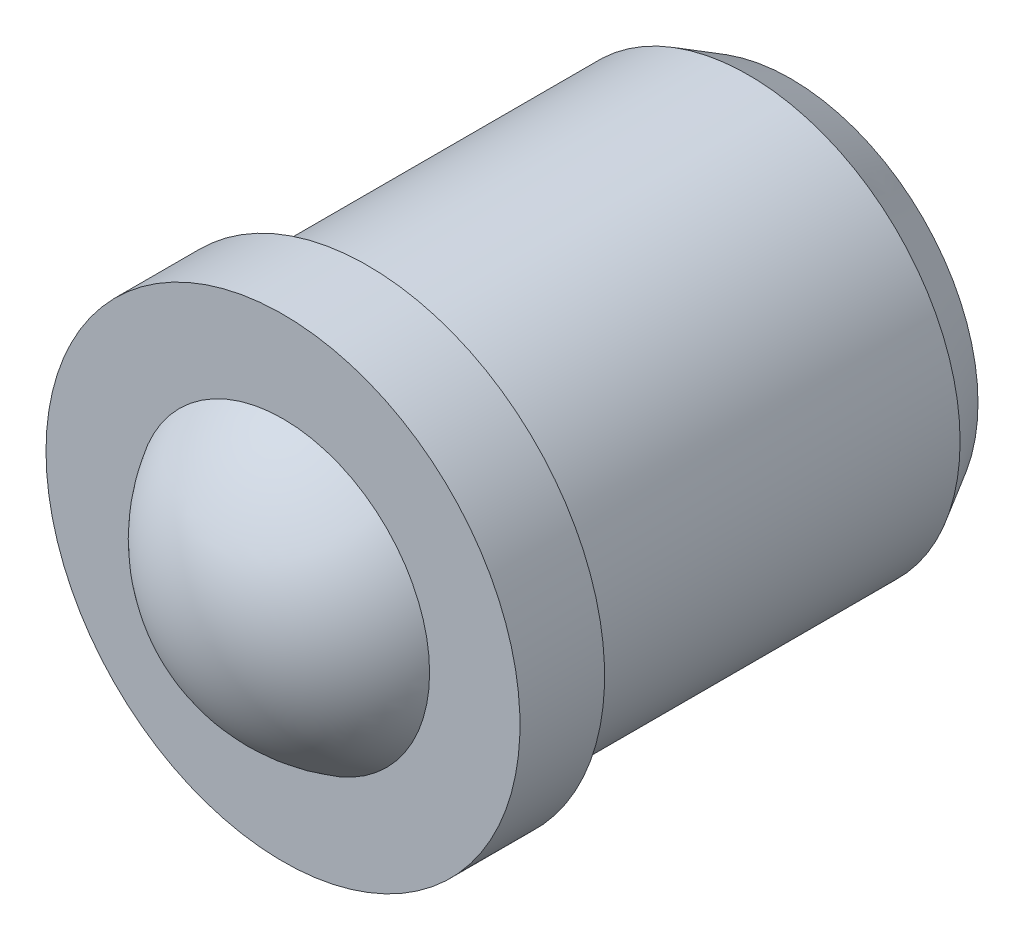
ISO-10303-21;
HEADER;
FILE_DESCRIPTION(('STEP AP214'),'2;1');
FILE_NAME('part.step','',(''),(''),'','','');
FILE_SCHEMA(('AUTOMOTIVE_DESIGN { 1 0 10303 214 1 1 1 1 }'));
ENDSEC;
DATA;
#1=APPLICATION_CONTEXT('core data for automotive mechanical design processes');
#2=APPLICATION_PROTOCOL_DEFINITION('international standard','automotive_design',2000,#1);
#3=PRODUCT_CONTEXT('',#1,'mechanical');
#4=PRODUCT('Part','Part','',(#3));
#5=PRODUCT_RELATED_PRODUCT_CATEGORY('part','',(#4));
#6=PRODUCT_DEFINITION_FORMATION('','',#4);
#7=PRODUCT_DEFINITION_CONTEXT('part definition',#1,'design');
#8=PRODUCT_DEFINITION('design','',#6,#7);
#9=PRODUCT_DEFINITION_SHAPE('','',#8);
#10=(LENGTH_UNIT() NAMED_UNIT(*) SI_UNIT(.MILLI.,.METRE.));
#11=(NAMED_UNIT(*) PLANE_ANGLE_UNIT() SI_UNIT($,.RADIAN.));
#12=(NAMED_UNIT(*) SI_UNIT($,.STERADIAN.) SOLID_ANGLE_UNIT());
#13=UNCERTAINTY_MEASURE_WITH_UNIT(LENGTH_MEASURE(1.E-05),#10,'distance_accuracy_value','');
#14=(GEOMETRIC_REPRESENTATION_CONTEXT(3) GLOBAL_UNCERTAINTY_ASSIGNED_CONTEXT((#13)) GLOBAL_UNIT_ASSIGNED_CONTEXT((#10,
#11,#12)) REPRESENTATION_CONTEXT('',''));
#15=CARTESIAN_POINT('',(0.,0.,0.));
#16=DIRECTION('',(0.,0.,1.));
#17=DIRECTION('',(1.,0.,0.));
#18=AXIS2_PLACEMENT_3D('',#15,#16,#17);
#19=CARTESIAN_POINT('',(0.,0.,0.));
#20=DIRECTION('',(-1.,0.,0.));
#21=DIRECTION('',(0.,0.,-1.));
#22=AXIS2_PLACEMENT_3D('',#19,#20,#21);
#23=SPHERICAL_SURFACE('',#22,2.);
#24=CARTESIAN_POINT('',(0.,0.,0.));
#25=DIRECTION('',(0.,0.,1.));
#26=DIRECTION('',(-1.,0.,0.));
#27=AXIS2_PLACEMENT_3D('',#24,#25,#26);
#28=SPHERICAL_SURFACE('',#27,2.);
#29=CARTESIAN_POINT('',(0.,0.,1.));
#30=DIRECTION('',(0.,0.,1.));
#31=DIRECTION('',(-1.,0.,0.));
#32=AXIS2_PLACEMENT_3D('',#29,#30,#31);
#33=CIRCLE('',#32,1.73205080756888);
#34=CARTESIAN_POINT('',(-1.73205080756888,0.,1.));
#35=VERTEX_POINT('',#34);
#36=EDGE_CURVE('E35',#35,#35,#33,.T.);
#37=ORIENTED_EDGE('',*,*,#36,.T.);
#38=EDGE_LOOP('',(#37));
#39=FACE_BOUND('',#38,.T.);
#40=ADVANCED_FACE('F12',(#39),#28,.T.);
#41=CARTESIAN_POINT('',(0.,0.,-5.));
#42=DIRECTION('',(0.,0.,1.));
#43=DIRECTION('',(-1.,0.,0.));
#44=AXIS2_PLACEMENT_3D('',#41,#42,#43);
#45=PLANE('',#44);
#46=CARTESIAN_POINT('',(0.,0.,-5.));
#47=DIRECTION('',(0.,0.,1.));
#48=DIRECTION('',(1.,0.,0.));
#49=AXIS2_PLACEMENT_3D('',#46,#47,#48);
#50=CIRCLE('',#49,2.21132486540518);
#51=CARTESIAN_POINT('',(2.21132486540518,0.,-5.));
#52=VERTEX_POINT('',#51);
#53=EDGE_CURVE('E8',#52,#52,#50,.F.);
#54=ORIENTED_EDGE('',*,*,#53,.T.);
#55=EDGE_LOOP('',(#54));
#56=FACE_BOUND('',#55,.T.);
#57=ADVANCED_FACE('F60',(#56),#45,.F.);
#58=CARTESIAN_POINT('',(0.,0.,2.));
#59=DIRECTION('',(0.,0.,1.));
#60=DIRECTION('',(-1.,0.,0.));
#61=AXIS2_PLACEMENT_3D('',#58,#59,#60);
#62=CYLINDRICAL_SURFACE('',#61,2.5);
#63=CARTESIAN_POINT('',(0.,0.,-4.5));
#64=DIRECTION('',(0.,0.,1.));
#65=DIRECTION('',(1.,0.,0.));
#66=AXIS2_PLACEMENT_3D('',#63,#64,#65);
#67=CIRCLE('',#66,2.5);
#68=CARTESIAN_POINT('',(2.5,0.,-4.5));
#69=VERTEX_POINT('',#68);
#70=EDGE_CURVE('E19',#69,#69,#67,.T.);
#71=ORIENTED_EDGE('',*,*,#70,.T.);
#72=EDGE_LOOP('',(#71));
#73=FACE_BOUND('',#72,.T.);
#74=CARTESIAN_POINT('',(0.,0.,0.));
#75=DIRECTION('',(0.,0.,1.));
#76=DIRECTION('',(-1.,0.,0.));
#77=AXIS2_PLACEMENT_3D('',#74,#75,#76);
#78=CIRCLE('',#77,2.5);
#79=CARTESIAN_POINT('',(-2.5,0.,0.));
#80=VERTEX_POINT('',#79);
#81=EDGE_CURVE('E23',#80,#80,#78,.T.);
#82=ORIENTED_EDGE('',*,*,#81,.F.);
#83=EDGE_LOOP('',(#82));
#84=FACE_BOUND('',#83,.T.);
#85=ADVANCED_FACE('F55',(#73,#84),#62,.T.);
#86=CARTESIAN_POINT('',(0.,-2.5,0.));
#87=DIRECTION('',(0.,0.,1.));
#88=DIRECTION('',(-1.,0.,0.));
#89=AXIS2_PLACEMENT_3D('',#86,#87,#88);
#90=PLANE('',#89);
#91=CARTESIAN_POINT('',(0.,0.,0.));
#92=DIRECTION('',(0.,0.,1.));
#93=DIRECTION('',(-1.,0.,0.));
#94=AXIS2_PLACEMENT_3D('',#91,#92,#93);
#95=CIRCLE('',#94,2.8);
#96=CARTESIAN_POINT('',(-2.8,0.,0.));
#97=VERTEX_POINT('',#96);
#98=EDGE_CURVE('E27',#97,#97,#95,.T.);
#99=ORIENTED_EDGE('',*,*,#98,.F.);
#100=EDGE_LOOP('',(#99));
#101=FACE_BOUND('',#100,.T.);
#102=ORIENTED_EDGE('',*,*,#81,.T.);
#103=EDGE_LOOP('',(#102));
#104=FACE_BOUND('',#103,.T.);
#105=ADVANCED_FACE('F49',(#101,#104),#90,.F.);
#106=CARTESIAN_POINT('',(0.,0.,2.));
#107=DIRECTION('',(0.,0.,1.));
#108=DIRECTION('',(-1.,0.,0.));
#109=AXIS2_PLACEMENT_3D('',#106,#107,#108);
#110=CYLINDRICAL_SURFACE('',#109,2.8);
#111=CARTESIAN_POINT('',(0.,0.,1.));
#112=DIRECTION('',(0.,0.,1.));
#113=DIRECTION('',(-1.,0.,0.));
#114=AXIS2_PLACEMENT_3D('',#111,#112,#113);
#115=CIRCLE('',#114,2.8);
#116=CARTESIAN_POINT('',(-2.8,0.,1.));
#117=VERTEX_POINT('',#116);
#118=EDGE_CURVE('E32',#117,#117,#115,.T.);
#119=ORIENTED_EDGE('',*,*,#118,.F.);
#120=EDGE_LOOP('',(#119));
#121=FACE_BOUND('',#120,.T.);
#122=ORIENTED_EDGE('',*,*,#98,.T.);
#123=EDGE_LOOP('',(#122));
#124=FACE_BOUND('',#123,.T.);
#125=ADVANCED_FACE('F43',(#121,#124),#110,.T.);
#126=CARTESIAN_POINT('',(0.,-2.8,1.));
#127=DIRECTION('',(0.,0.,-1.));
#128=DIRECTION('',(1.,0.,0.));
#129=AXIS2_PLACEMENT_3D('',#126,#127,#128);
#130=PLANE('',#129);
#131=ORIENTED_EDGE('',*,*,#36,.F.);
#132=EDGE_LOOP('',(#131));
#133=FACE_BOUND('',#132,.T.);
#134=ORIENTED_EDGE('',*,*,#118,.T.);
#135=EDGE_LOOP('',(#134));
#136=FACE_BOUND('',#135,.T.);
#137=ADVANCED_FACE('F40',(#133,#136),#130,.F.);
#138=CARTESIAN_POINT('',(0.,0.,-4.5));
#139=DIRECTION('',(0.,0.,1.));
#140=DIRECTION('',(1.,0.,0.));
#141=AXIS2_PLACEMENT_3D('',#138,#139,#140);
#142=CONICAL_SURFACE('',#141,2.5,0.523598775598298);
#143=ORIENTED_EDGE('',*,*,#53,.F.);
#144=EDGE_LOOP('',(#143));
#145=FACE_BOUND('',#144,.T.);
#146=ORIENTED_EDGE('',*,*,#70,.F.);
#147=EDGE_LOOP('',(#146));
#148=FACE_BOUND('',#147,.T.);
#149=ADVANCED_FACE('F14',(#145,#148),#142,.T.);
#150=CLOSED_SHELL('',(#40,#57,#85,#105,#125,#137,#149));
#151=MANIFOLD_SOLID_BREP('B1',#150);
#152=ADVANCED_BREP_SHAPE_REPRESENTATION('',(#18,#151),#14);
#153=SHAPE_DEFINITION_REPRESENTATION(#9,#152);
ENDSEC;
END-ISO-10303-21;
